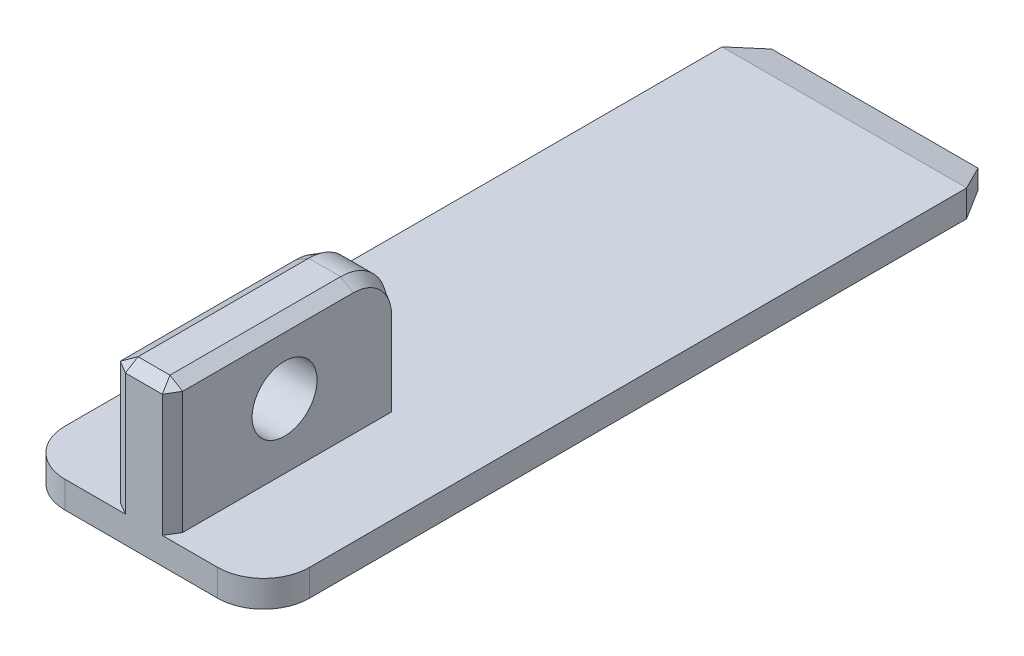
ISO-10303-21;
HEADER;
FILE_DESCRIPTION(('STEP AP214'),'2;1');
FILE_NAME('part.step','',(''),(''),'','','');
FILE_SCHEMA(('AUTOMOTIVE_DESIGN { 1 0 10303 214 1 1 1 1 }'));
ENDSEC;
DATA;
#1=APPLICATION_CONTEXT('core data for automotive mechanical design processes');
#2=APPLICATION_PROTOCOL_DEFINITION('international standard','automotive_design',2000,#1);
#3=PRODUCT_CONTEXT('',#1,'mechanical');
#4=PRODUCT('Part','Part','',(#3));
#5=PRODUCT_RELATED_PRODUCT_CATEGORY('part','',(#4));
#6=PRODUCT_DEFINITION_FORMATION('','',#4);
#7=PRODUCT_DEFINITION_CONTEXT('part definition',#1,'design');
#8=PRODUCT_DEFINITION('design','',#6,#7);
#9=PRODUCT_DEFINITION_SHAPE('','',#8);
#10=(LENGTH_UNIT() NAMED_UNIT(*) SI_UNIT(.MILLI.,.METRE.));
#11=(NAMED_UNIT(*) PLANE_ANGLE_UNIT() SI_UNIT($,.RADIAN.));
#12=(NAMED_UNIT(*) SI_UNIT($,.STERADIAN.) SOLID_ANGLE_UNIT());
#13=UNCERTAINTY_MEASURE_WITH_UNIT(LENGTH_MEASURE(1.E-05),#10,'distance_accuracy_value','');
#14=(GEOMETRIC_REPRESENTATION_CONTEXT(3) GLOBAL_UNCERTAINTY_ASSIGNED_CONTEXT((#13)) GLOBAL_UNIT_ASSIGNED_CONTEXT((#10,
#11,#12)) REPRESENTATION_CONTEXT('',''));
#15=CARTESIAN_POINT('',(0.,0.,0.));
#16=DIRECTION('',(0.,0.,1.));
#17=DIRECTION('',(1.,0.,0.));
#18=AXIS2_PLACEMENT_3D('',#15,#16,#17);
#19=CARTESIAN_POINT('',(-16.,1.75,96.));
#20=DIRECTION('',(0.,-1.,0.));
#21=DIRECTION('',(0.,0.,-1.));
#22=AXIS2_PLACEMENT_3D('',#19,#20,#21);
#23=PLANE('',#22);
#24=DIRECTION('',(0.,0.,-1.));
#25=VECTOR('',#24,1.);
#26=CARTESIAN_POINT('',(-16.,1.75,96.));
#27=LINE('',#26,#25);
#28=CARTESIAN_POINT('',(-16.,1.75,90.));
#29=VERTEX_POINT('',#28);
#30=CARTESIAN_POINT('',(-16.,1.75,4.00000000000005));
#31=VERTEX_POINT('',#30);
#32=EDGE_CURVE('E184',#29,#31,#27,.T.);
#33=ORIENTED_EDGE('',*,*,#32,.F.);
#34=CARTESIAN_POINT('',(-10.,1.75,90.));
#35=DIRECTION('',(0.,-1.,0.));
#36=DIRECTION('',(0.,0.,-1.));
#37=AXIS2_PLACEMENT_3D('',#34,#35,#36);
#38=CIRCLE('',#37,6.);
#39=CARTESIAN_POINT('',(-10.,1.75,96.));
#40=VERTEX_POINT('',#39);
#41=EDGE_CURVE('E245',#29,#40,#38,.F.);
#42=ORIENTED_EDGE('',*,*,#41,.T.);
#43=DIRECTION('',(-1.,0.,0.));
#44=VECTOR('',#43,1.);
#45=CARTESIAN_POINT('',(-16.,1.75,96.));
#46=LINE('',#45,#44);
#47=CARTESIAN_POINT('',(-2.08572051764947,1.75,96.));
#48=VERTEX_POINT('',#47);
#49=EDGE_CURVE('E341',#48,#40,#46,.T.);
#50=ORIENTED_EDGE('',*,*,#49,.F.);
#51=DIRECTION('',(-0.857167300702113,0.,-0.515038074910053));
#52=VECTOR('',#51,1.);
#53=CARTESIAN_POINT('',(-12.3090395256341,1.75,89.8572102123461));
#54=LINE('',#53,#52);
#55=CARTESIAN_POINT('',(-3.75,1.75,95.));
#56=VERTEX_POINT('',#55);
#57=EDGE_CURVE('E11',#48,#56,#54,.T.);
#58=ORIENTED_EDGE('',*,*,#57,.T.);
#59=DIRECTION('',(0.,0.,1.));
#60=VECTOR('',#59,1.);
#61=CARTESIAN_POINT('',(-3.75,1.75,96.));
#62=LINE('',#61,#60);
#63=CARTESIAN_POINT('',(-3.75,1.75,67.));
#64=VERTEX_POINT('',#63);
#65=EDGE_CURVE('E334',#64,#56,#62,.T.);
#66=ORIENTED_EDGE('',*,*,#65,.F.);
#67=DIRECTION('',(-0.857167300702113,0.,0.515038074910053));
#68=VECTOR('',#67,1.);
#69=CARTESIAN_POINT('',(-25.553253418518,1.75,80.1007163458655));
#70=LINE('',#69,#68);
#71=CARTESIAN_POINT('',(-2.08572051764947,1.75,66.));
#72=VERTEX_POINT('',#71);
#73=EDGE_CURVE('E287',#64,#72,#70,.F.);
#74=ORIENTED_EDGE('',*,*,#73,.T.);
#75=DIRECTION('',(-1.,0.,0.));
#76=VECTOR('',#75,1.);
#77=CARTESIAN_POINT('',(-3.75,1.75,66.));
#78=LINE('',#77,#76);
#79=CARTESIAN_POINT('',(2.08572051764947,1.75,66.));
#80=VERTEX_POINT('',#79);
#81=EDGE_CURVE('E331',#80,#72,#78,.T.);
#82=ORIENTED_EDGE('',*,*,#81,.F.);
#83=DIRECTION('',(-0.857167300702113,0.,-0.515038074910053));
#84=VECTOR('',#83,1.);
#85=CARTESIAN_POINT('',(2.04170841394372,1.75,65.9735548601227));
#86=LINE('',#85,#84);
#87=CARTESIAN_POINT('',(3.75,1.75,67.));
#88=VERTEX_POINT('',#87);
#89=EDGE_CURVE('E285',#80,#88,#86,.F.);
#90=ORIENTED_EDGE('',*,*,#89,.T.);
#91=DIRECTION('',(0.,0.,-1.));
#92=VECTOR('',#91,1.);
#93=CARTESIAN_POINT('',(3.75,1.75,96.));
#94=LINE('',#93,#92);
#95=CARTESIAN_POINT('',(3.75,1.75,94.3357205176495));
#96=VERTEX_POINT('',#95);
#97=EDGE_CURVE('E226',#96,#88,#94,.T.);
#98=ORIENTED_EDGE('',*,*,#97,.F.);
#99=DIRECTION('',(-0.515038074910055,0.,0.857167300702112));
#100=VECTOR('',#99,1.);
#101=CARTESIAN_POINT('',(-2.22370409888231,1.75,104.277633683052));
#102=LINE('',#101,#100);
#103=CARTESIAN_POINT('',(2.74999999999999,1.75,96.));
#104=VERTEX_POINT('',#103);
#105=EDGE_CURVE('E51',#96,#104,#102,.T.);
#106=ORIENTED_EDGE('',*,*,#105,.T.);
#107=CARTESIAN_POINT('',(10.,1.75,96.));
#108=VERTEX_POINT('',#107);
#109=EDGE_CURVE('E338',#108,#104,#46,.T.);
#110=ORIENTED_EDGE('',*,*,#109,.F.);
#111=CARTESIAN_POINT('',(10.,1.75,90.));
#112=DIRECTION('',(0.,-1.,0.));
#113=DIRECTION('',(0.,0.,-1.));
#114=AXIS2_PLACEMENT_3D('',#111,#112,#113);
#115=CIRCLE('',#114,6.);
#116=CARTESIAN_POINT('',(16.,1.75,90.));
#117=VERTEX_POINT('',#116);
#118=EDGE_CURVE('E243',#108,#117,#115,.F.);
#119=ORIENTED_EDGE('',*,*,#118,.T.);
#120=DIRECTION('',(0.,0.,-1.));
#121=VECTOR('',#120,1.);
#122=CARTESIAN_POINT('',(16.,1.75,96.));
#123=LINE('',#122,#121);
#124=CARTESIAN_POINT('',(16.,1.75,4.00000000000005));
#125=VERTEX_POINT('',#124);
#126=EDGE_CURVE('E200',#117,#125,#123,.T.);
#127=ORIENTED_EDGE('',*,*,#126,.T.);
#128=DIRECTION('',(-1.,0.,0.));
#129=VECTOR('',#128,1.);
#130=CARTESIAN_POINT('',(-16.,1.75,4.00000000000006));
#131=LINE('',#130,#129);
#132=EDGE_CURVE('E212',#125,#31,#131,.T.);
#133=ORIENTED_EDGE('',*,*,#132,.T.);
#134=EDGE_LOOP('',(#33,#42,#50,#58,#66,#74,#82,#90,#98,#106,#110,#119,#127,#133));
#135=FACE_BOUND('',#134,.T.);
#136=ADVANCED_FACE('F41',(#135),#23,.F.);
#137=CARTESIAN_POINT('',(16.,1.75,96.));
#138=DIRECTION('',(-1.,0.,0.));
#139=DIRECTION('',(0.,0.,1.));
#140=AXIS2_PLACEMENT_3D('',#137,#138,#139);
#141=PLANE('',#140);
#142=ORIENTED_EDGE('',*,*,#126,.F.);
#143=DIRECTION('',(0.,1.,0.));
#144=VECTOR('',#143,1.);
#145=CARTESIAN_POINT('',(16.,-1.75,90.));
#146=LINE('',#145,#144);
#147=CARTESIAN_POINT('',(16.,-1.75,90.));
#148=VERTEX_POINT('',#147);
#149=EDGE_CURVE('E247',#117,#148,#146,.F.);
#150=ORIENTED_EDGE('',*,*,#149,.T.);
#151=DIRECTION('',(0.,0.,-1.));
#152=VECTOR('',#151,1.);
#153=CARTESIAN_POINT('',(16.,-1.75,96.));
#154=LINE('',#153,#152);
#155=CARTESIAN_POINT('',(16.,-1.75,4.00000000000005));
#156=VERTEX_POINT('',#155);
#157=EDGE_CURVE('E185',#148,#156,#154,.T.);
#158=ORIENTED_EDGE('',*,*,#157,.T.);
#159=DIRECTION('',(0.,1.,0.));
#160=VECTOR('',#159,1.);
#161=CARTESIAN_POINT('',(16.,1.75,4.00000000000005));
#162=LINE('',#161,#160);
#163=EDGE_CURVE('E209',#156,#125,#162,.T.);
#164=ORIENTED_EDGE('',*,*,#163,.T.);
#165=EDGE_LOOP('',(#142,#150,#158,#164));
#166=FACE_BOUND('',#165,.T.);
#167=ADVANCED_FACE('F348',(#166),#141,.F.);
#168=CARTESIAN_POINT('',(-16.,1.75,96.));
#169=DIRECTION('',(1.,0.,0.));
#170=DIRECTION('',(0.,0.,-1.));
#171=AXIS2_PLACEMENT_3D('',#168,#169,#170);
#172=PLANE('',#171);
#173=DIRECTION('',(0.,0.,-1.));
#174=VECTOR('',#173,1.);
#175=CARTESIAN_POINT('',(-16.,-1.75,96.));
#176=LINE('',#175,#174);
#177=CARTESIAN_POINT('',(-16.,-1.75,90.));
#178=VERTEX_POINT('',#177);
#179=CARTESIAN_POINT('',(-16.,-1.75,4.00000000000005));
#180=VERTEX_POINT('',#179);
#181=EDGE_CURVE('E173',#178,#180,#176,.T.);
#182=ORIENTED_EDGE('',*,*,#181,.F.);
#183=DIRECTION('',(0.,-1.,0.));
#184=VECTOR('',#183,1.);
#185=CARTESIAN_POINT('',(-16.,1.75,90.));
#186=LINE('',#185,#184);
#187=EDGE_CURVE('E241',#178,#29,#186,.F.);
#188=ORIENTED_EDGE('',*,*,#187,.T.);
#189=ORIENTED_EDGE('',*,*,#32,.T.);
#190=DIRECTION('',(0.,-1.,0.));
#191=VECTOR('',#190,1.);
#192=CARTESIAN_POINT('',(-16.,1.75,4.00000000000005));
#193=LINE('',#192,#191);
#194=EDGE_CURVE('E191',#31,#180,#193,.T.);
#195=ORIENTED_EDGE('',*,*,#194,.T.);
#196=EDGE_LOOP('',(#182,#188,#189,#195));
#197=FACE_BOUND('',#196,.T.);
#198=ADVANCED_FACE('F197',(#197),#172,.F.);
#199=CARTESIAN_POINT('',(-16.,-1.75,96.));
#200=DIRECTION('',(0.,1.,0.));
#201=DIRECTION('',(0.,0.,1.));
#202=AXIS2_PLACEMENT_3D('',#199,#200,#201);
#203=PLANE('',#202);
#204=DIRECTION('',(1.,0.,0.));
#205=VECTOR('',#204,1.);
#206=CARTESIAN_POINT('',(-16.,-1.75,96.));
#207=LINE('',#206,#205);
#208=CARTESIAN_POINT('',(-10.,-1.75,96.));
#209=VERTEX_POINT('',#208);
#210=CARTESIAN_POINT('',(10.,-1.75,96.));
#211=VERTEX_POINT('',#210);
#212=EDGE_CURVE('E340',#209,#211,#207,.T.);
#213=ORIENTED_EDGE('',*,*,#212,.F.);
#214=CARTESIAN_POINT('',(-10.,-1.75,90.));
#215=DIRECTION('',(0.,1.,0.));
#216=DIRECTION('',(0.,0.,1.));
#217=AXIS2_PLACEMENT_3D('',#214,#215,#216);
#218=CIRCLE('',#217,6.);
#219=EDGE_CURVE('E180',#209,#178,#218,.F.);
#220=ORIENTED_EDGE('',*,*,#219,.T.);
#221=ORIENTED_EDGE('',*,*,#181,.T.);
#222=DIRECTION('',(-0.529998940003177,0.,0.84799830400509));
#223=VECTOR('',#222,1.);
#224=CARTESIAN_POINT('',(-16.,-1.75,4.00000000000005));
#225=LINE('',#224,#223);
#226=CARTESIAN_POINT('',(-13.5,-1.75,0.));
#227=VERTEX_POINT('',#226);
#228=EDGE_CURVE('E178',#180,#227,#225,.F.);
#229=ORIENTED_EDGE('',*,*,#228,.T.);
#230=DIRECTION('',(1.,0.,0.));
#231=VECTOR('',#230,1.);
#232=CARTESIAN_POINT('',(-16.,-1.75,0.));
#233=LINE('',#232,#231);
#234=CARTESIAN_POINT('',(13.5,-1.75,0.));
#235=VERTEX_POINT('',#234);
#236=EDGE_CURVE('E337',#227,#235,#233,.T.);
#237=ORIENTED_EDGE('',*,*,#236,.T.);
#238=DIRECTION('',(-0.529998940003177,0.,-0.84799830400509));
#239=VECTOR('',#238,1.);
#240=CARTESIAN_POINT('',(16.,-1.75,4.00000000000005));
#241=LINE('',#240,#239);
#242=EDGE_CURVE('E195',#235,#156,#241,.F.);
#243=ORIENTED_EDGE('',*,*,#242,.T.);
#244=ORIENTED_EDGE('',*,*,#157,.F.);
#245=CARTESIAN_POINT('',(10.,-1.75,90.));
#246=DIRECTION('',(0.,1.,0.));
#247=DIRECTION('',(0.,0.,1.));
#248=AXIS2_PLACEMENT_3D('',#245,#246,#247);
#249=CIRCLE('',#248,6.);
#250=EDGE_CURVE('E238',#148,#211,#249,.F.);
#251=ORIENTED_EDGE('',*,*,#250,.T.);
#252=EDGE_LOOP('',(#213,#220,#221,#229,#237,#243,#244,#251));
#253=FACE_BOUND('',#252,.T.);
#254=ADVANCED_FACE('F176',(#253),#203,.F.);
#255=CARTESIAN_POINT('',(0.,0.,96.));
#256=DIRECTION('',(0.,0.,1.));
#257=DIRECTION('',(1.,0.,0.));
#258=AXIS2_PLACEMENT_3D('',#255,#256,#257);
#259=PLANE('',#258);
#260=DIRECTION('',(0.,-1.,0.));
#261=VECTOR('',#260,1.);
#262=CARTESIAN_POINT('',(-2.08572051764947,1.75,96.));
#263=LINE('',#262,#261);
#264=CARTESIAN_POINT('',(-2.08572051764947,17.75,96.));
#265=VERTEX_POINT('',#264);
#266=EDGE_CURVE('E276',#265,#48,#263,.T.);
#267=ORIENTED_EDGE('',*,*,#266,.T.);
#268=ORIENTED_EDGE('',*,*,#49,.T.);
#269=DIRECTION('',(0.,-1.,0.));
#270=VECTOR('',#269,1.);
#271=CARTESIAN_POINT('',(-10.,-1.75,96.));
#272=LINE('',#271,#270);
#273=EDGE_CURVE('E235',#40,#209,#272,.T.);
#274=ORIENTED_EDGE('',*,*,#273,.T.);
#275=ORIENTED_EDGE('',*,*,#212,.T.);
#276=DIRECTION('',(0.,1.,0.));
#277=VECTOR('',#276,1.);
#278=CARTESIAN_POINT('',(10.,1.75,96.));
#279=LINE('',#278,#277);
#280=EDGE_CURVE('E232',#211,#108,#279,.T.);
#281=ORIENTED_EDGE('',*,*,#280,.T.);
#282=ORIENTED_EDGE('',*,*,#109,.T.);
#283=DIRECTION('',(0.,1.,0.));
#284=VECTOR('',#283,1.);
#285=CARTESIAN_POINT('',(2.74999999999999,18.75,96.));
#286=LINE('',#285,#284);
#287=CARTESIAN_POINT('',(2.74999999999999,17.75,96.));
#288=VERTEX_POINT('',#287);
#289=EDGE_CURVE('E279',#104,#288,#286,.T.);
#290=ORIENTED_EDGE('',*,*,#289,.T.);
#291=DIRECTION('',(-1.,0.,0.));
#292=VECTOR('',#291,1.);
#293=CARTESIAN_POINT('',(-3.75,17.75,96.));
#294=LINE('',#293,#292);
#295=EDGE_CURVE('E274',#288,#265,#294,.T.);
#296=ORIENTED_EDGE('',*,*,#295,.T.);
#297=EDGE_LOOP('',(#267,#268,#274,#275,#281,#282,#290,#296));
#298=FACE_BOUND('',#297,.T.);
#299=ADVANCED_FACE('F368',(#298),#259,.T.);
#300=CARTESIAN_POINT('',(0.,0.,0.));
#301=DIRECTION('',(0.,0.,1.));
#302=DIRECTION('',(1.,0.,0.));
#303=AXIS2_PLACEMENT_3D('',#300,#301,#302);
#304=PLANE('',#303);
#305=DIRECTION('',(0.,1.,0.));
#306=VECTOR('',#305,1.);
#307=CARTESIAN_POINT('',(-13.5,0.,0.));
#308=LINE('',#307,#306);
#309=CARTESIAN_POINT('',(-13.5,0.749999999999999,0.));
#310=VERTEX_POINT('',#309);
#311=EDGE_CURVE('E193',#227,#310,#308,.T.);
#312=ORIENTED_EDGE('',*,*,#311,.T.);
#313=DIRECTION('',(1.,0.,0.));
#314=VECTOR('',#313,1.);
#315=CARTESIAN_POINT('',(0.,0.749999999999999,0.));
#316=LINE('',#315,#314);
#317=CARTESIAN_POINT('',(13.5,0.749999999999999,0.));
#318=VERTEX_POINT('',#317);
#319=EDGE_CURVE('E217',#310,#318,#316,.T.);
#320=ORIENTED_EDGE('',*,*,#319,.T.);
#321=DIRECTION('',(0.,-1.,0.));
#322=VECTOR('',#321,1.);
#323=CARTESIAN_POINT('',(13.5,0.,0.));
#324=LINE('',#323,#322);
#325=EDGE_CURVE('E194',#318,#235,#324,.T.);
#326=ORIENTED_EDGE('',*,*,#325,.T.);
#327=ORIENTED_EDGE('',*,*,#236,.F.);
#328=EDGE_LOOP('',(#312,#320,#326,#327));
#329=FACE_BOUND('',#328,.T.);
#330=ADVANCED_FACE('F451',(#329),#304,.F.);
#331=CARTESIAN_POINT('',(-16.,1.75,4.00000000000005));
#332=DIRECTION('',(0.84799830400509,0.,0.529998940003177));
#333=DIRECTION('',(0.,-1.,0.));
#334=AXIS2_PLACEMENT_3D('',#331,#332,#333);
#335=PLANE('',#334);
#336=ORIENTED_EDGE('',*,*,#194,.F.);
#337=DIRECTION('',(0.51847584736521,-0.207390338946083,-0.829561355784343));
#338=VECTOR('',#337,1.);
#339=CARTESIAN_POINT('',(-16.,1.75,4.00000000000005));
#340=LINE('',#339,#338);
#341=EDGE_CURVE('E215',#31,#310,#340,.T.);
#342=ORIENTED_EDGE('',*,*,#341,.T.);
#343=ORIENTED_EDGE('',*,*,#311,.F.);
#344=ORIENTED_EDGE('',*,*,#228,.F.);
#345=EDGE_LOOP('',(#336,#342,#343,#344));
#346=FACE_BOUND('',#345,.T.);
#347=ADVANCED_FACE('F190',(#346),#335,.F.);
#348=CARTESIAN_POINT('',(16.,1.75,4.00000000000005));
#349=DIRECTION('',(-0.84799830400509,0.,0.529998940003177));
#350=DIRECTION('',(0.,1.,0.));
#351=AXIS2_PLACEMENT_3D('',#348,#349,#350);
#352=PLANE('',#351);
#353=ORIENTED_EDGE('',*,*,#325,.F.);
#354=DIRECTION('',(0.51847584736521,0.207390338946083,0.829561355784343));
#355=VECTOR('',#354,1.);
#356=CARTESIAN_POINT('',(16.,1.75,4.00000000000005));
#357=LINE('',#356,#355);
#358=EDGE_CURVE('E219',#318,#125,#357,.T.);
#359=ORIENTED_EDGE('',*,*,#358,.T.);
#360=ORIENTED_EDGE('',*,*,#163,.F.);
#361=ORIENTED_EDGE('',*,*,#242,.F.);
#362=EDGE_LOOP('',(#353,#359,#360,#361));
#363=FACE_BOUND('',#362,.T.);
#364=ADVANCED_FACE('F356',(#363),#352,.F.);
#365=CARTESIAN_POINT('',(-16.,1.75,4.00000000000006));
#366=DIRECTION('',(0.,-0.970142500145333,0.24253562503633));
#367=DIRECTION('',(-1.,0.,0.));
#368=AXIS2_PLACEMENT_3D('',#365,#366,#367);
#369=PLANE('',#368);
#370=ORIENTED_EDGE('',*,*,#358,.F.);
#371=ORIENTED_EDGE('',*,*,#319,.F.);
#372=ORIENTED_EDGE('',*,*,#341,.F.);
#373=ORIENTED_EDGE('',*,*,#132,.F.);
#374=EDGE_LOOP('',(#370,#371,#372,#373));
#375=FACE_BOUND('',#374,.T.);
#376=ADVANCED_FACE('F360',(#375),#369,.F.);
#377=CARTESIAN_POINT('',(3.75,18.75,96.));
#378=DIRECTION('',(-1.,0.,0.));
#379=DIRECTION('',(0.,0.,1.));
#380=AXIS2_PLACEMENT_3D('',#377,#378,#379);
#381=PLANE('',#380);
#382=ORIENTED_EDGE('',*,*,#97,.T.);
#383=DIRECTION('',(0.,1.,0.));
#384=VECTOR('',#383,1.);
#385=CARTESIAN_POINT('',(3.75,18.75,67.));
#386=LINE('',#385,#384);
#387=CARTESIAN_POINT('',(3.75,12.75,67.));
#388=VERTEX_POINT('',#387);
#389=EDGE_CURVE('E260',#88,#388,#386,.T.);
#390=ORIENTED_EDGE('',*,*,#389,.T.);
#391=CARTESIAN_POINT('',(3.75,12.75,72.));
#392=DIRECTION('',(-1.,0.,0.));
#393=DIRECTION('',(0.,0.,1.));
#394=AXIS2_PLACEMENT_3D('',#391,#392,#393);
#395=CIRCLE('',#394,4.99999999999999);
#396=CARTESIAN_POINT('',(3.75,17.75,72.));
#397=VERTEX_POINT('',#396);
#398=EDGE_CURVE('E258',#388,#397,#395,.F.);
#399=ORIENTED_EDGE('',*,*,#398,.T.);
#400=DIRECTION('',(0.,0.,1.));
#401=VECTOR('',#400,1.);
#402=CARTESIAN_POINT('',(3.75,17.75,96.));
#403=LINE('',#402,#401);
#404=CARTESIAN_POINT('',(3.75,17.75,94.3357205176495));
#405=VERTEX_POINT('',#404);
#406=EDGE_CURVE('E254',#397,#405,#403,.T.);
#407=ORIENTED_EDGE('',*,*,#406,.T.);
#408=DIRECTION('',(0.,-1.,0.));
#409=VECTOR('',#408,1.);
#410=CARTESIAN_POINT('',(3.75,1.75,94.3357205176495));
#411=LINE('',#410,#409);
#412=EDGE_CURVE('E256',#405,#96,#411,.T.);
#413=ORIENTED_EDGE('',*,*,#412,.T.);
#414=EDGE_LOOP('',(#382,#390,#399,#407,#413));
#415=FACE_BOUND('',#414,.T.);
#416=CARTESIAN_POINT('',(3.74999999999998,10.25,81.));
#417=DIRECTION('',(1.,0.,0.));
#418=DIRECTION('',(0.,0.,-1.));
#419=AXIS2_PLACEMENT_3D('',#416,#417,#418);
#420=CIRCLE('',#419,4.25000000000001);
#421=CARTESIAN_POINT('',(3.74999999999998,10.25,76.75));
#422=VERTEX_POINT('',#421);
#423=EDGE_CURVE('E227',#422,#422,#420,.T.);
#424=ORIENTED_EDGE('',*,*,#423,.F.);
#425=EDGE_LOOP('',(#424));
#426=FACE_BOUND('',#425,.T.);
#427=ADVANCED_FACE('F420',(#415,#426),#381,.F.);
#428=CARTESIAN_POINT('',(-3.75,18.75,66.));
#429=DIRECTION('',(0.,0.,1.));
#430=DIRECTION('',(1.,0.,0.));
#431=AXIS2_PLACEMENT_3D('',#428,#429,#430);
#432=PLANE('',#431);
#433=DIRECTION('',(-1.,0.,0.));
#434=VECTOR('',#433,1.);
#435=CARTESIAN_POINT('',(-3.75,12.75,66.));
#436=LINE('',#435,#434);
#437=CARTESIAN_POINT('',(-2.08572051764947,12.75,66.));
#438=VERTEX_POINT('',#437);
#439=CARTESIAN_POINT('',(2.08572051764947,12.75,66.));
#440=VERTEX_POINT('',#439);
#441=EDGE_CURVE('E229',#438,#440,#436,.F.);
#442=ORIENTED_EDGE('',*,*,#441,.T.);
#443=DIRECTION('',(0.,-1.,0.));
#444=VECTOR('',#443,1.);
#445=CARTESIAN_POINT('',(2.08572051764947,18.75,66.));
#446=LINE('',#445,#444);
#447=EDGE_CURVE('E251',#440,#80,#446,.T.);
#448=ORIENTED_EDGE('',*,*,#447,.T.);
#449=ORIENTED_EDGE('',*,*,#81,.T.);
#450=DIRECTION('',(0.,1.,0.));
#451=VECTOR('',#450,1.);
#452=CARTESIAN_POINT('',(-2.08572051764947,18.75,66.));
#453=LINE('',#452,#451);
#454=EDGE_CURVE('E249',#72,#438,#453,.T.);
#455=ORIENTED_EDGE('',*,*,#454,.T.);
#456=EDGE_LOOP('',(#442,#448,#449,#455));
#457=FACE_BOUND('',#456,.T.);
#458=ADVANCED_FACE('F411',(#457),#432,.F.);
#459=CARTESIAN_POINT('',(-3.75,18.75,96.));
#460=DIRECTION('',(1.,0.,0.));
#461=DIRECTION('',(0.,0.,-1.));
#462=AXIS2_PLACEMENT_3D('',#459,#460,#461);
#463=PLANE('',#462);
#464=CARTESIAN_POINT('',(-3.75,10.25,81.));
#465=DIRECTION('',(1.,0.,0.));
#466=DIRECTION('',(0.,0.,-1.));
#467=AXIS2_PLACEMENT_3D('',#464,#465,#466);
#468=CIRCLE('',#467,4.25000000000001);
#469=CARTESIAN_POINT('',(-3.75,10.25,76.75));
#470=VERTEX_POINT('',#469);
#471=EDGE_CURVE('E223',#470,#470,#468,.T.);
#472=ORIENTED_EDGE('',*,*,#471,.T.);
#473=EDGE_LOOP('',(#472));
#474=FACE_BOUND('',#473,.T.);
#475=CARTESIAN_POINT('',(-3.75,12.75,72.));
#476=DIRECTION('',(1.,0.,0.));
#477=DIRECTION('',(0.,0.,-1.));
#478=AXIS2_PLACEMENT_3D('',#475,#476,#477);
#479=CIRCLE('',#478,4.99999999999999);
#480=CARTESIAN_POINT('',(-3.75,17.75,72.));
#481=VERTEX_POINT('',#480);
#482=CARTESIAN_POINT('',(-3.75,12.75,67.));
#483=VERTEX_POINT('',#482);
#484=EDGE_CURVE('E266',#481,#483,#479,.F.);
#485=ORIENTED_EDGE('',*,*,#484,.T.);
#486=DIRECTION('',(0.,-1.,0.));
#487=VECTOR('',#486,1.);
#488=CARTESIAN_POINT('',(-3.75,18.75,67.));
#489=LINE('',#488,#487);
#490=EDGE_CURVE('E268',#483,#64,#489,.T.);
#491=ORIENTED_EDGE('',*,*,#490,.T.);
#492=ORIENTED_EDGE('',*,*,#65,.T.);
#493=DIRECTION('',(0.,1.,0.));
#494=VECTOR('',#493,1.);
#495=CARTESIAN_POINT('',(-3.75,18.75,95.));
#496=LINE('',#495,#494);
#497=CARTESIAN_POINT('',(-3.75,17.75,95.));
#498=VERTEX_POINT('',#497);
#499=EDGE_CURVE('E264',#56,#498,#496,.T.);
#500=ORIENTED_EDGE('',*,*,#499,.T.);
#501=DIRECTION('',(0.,0.,-1.));
#502=VECTOR('',#501,1.);
#503=CARTESIAN_POINT('',(-3.75,17.75,96.));
#504=LINE('',#503,#502);
#505=EDGE_CURVE('E262',#498,#481,#504,.T.);
#506=ORIENTED_EDGE('',*,*,#505,.T.);
#507=EDGE_LOOP('',(#485,#491,#492,#500,#506));
#508=FACE_BOUND('',#507,.T.);
#509=ADVANCED_FACE('F382',(#474,#508),#463,.F.);
#510=CARTESIAN_POINT('',(0.,18.75,0.));
#511=DIRECTION('',(0.,-1.,0.));
#512=DIRECTION('',(0.,0.,-1.));
#513=AXIS2_PLACEMENT_3D('',#510,#511,#512);
#514=PLANE('',#513);
#515=DIRECTION('',(1.,0.,0.));
#516=VECTOR('',#515,1.);
#517=CARTESIAN_POINT('',(3.75,18.75,94.3357205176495));
#518=LINE('',#517,#516);
#519=CARTESIAN_POINT('',(-2.08572051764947,18.75,94.3357205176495));
#520=VERTEX_POINT('',#519);
#521=CARTESIAN_POINT('',(2.08572051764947,18.75,94.3357205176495));
#522=VERTEX_POINT('',#521);
#523=EDGE_CURVE('E59',#520,#522,#518,.T.);
#524=ORIENTED_EDGE('',*,*,#523,.T.);
#525=DIRECTION('',(0.,0.,-1.));
#526=VECTOR('',#525,1.);
#527=CARTESIAN_POINT('',(2.08572051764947,18.75,0.));
#528=LINE('',#527,#526);
#529=CARTESIAN_POINT('',(2.08572051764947,18.75,72.));
#530=VERTEX_POINT('',#529);
#531=EDGE_CURVE('E283',#522,#530,#528,.T.);
#532=ORIENTED_EDGE('',*,*,#531,.T.);
#533=DIRECTION('',(-1.,0.,0.));
#534=VECTOR('',#533,1.);
#535=CARTESIAN_POINT('',(0.,18.75,72.));
#536=LINE('',#535,#534);
#537=CARTESIAN_POINT('',(-2.08572051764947,18.75,72.));
#538=VERTEX_POINT('',#537);
#539=EDGE_CURVE('E222',#530,#538,#536,.T.);
#540=ORIENTED_EDGE('',*,*,#539,.T.);
#541=DIRECTION('',(0.,0.,1.));
#542=VECTOR('',#541,1.);
#543=CARTESIAN_POINT('',(-2.08572051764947,18.75,0.));
#544=LINE('',#543,#542);
#545=EDGE_CURVE('E64',#538,#520,#544,.T.);
#546=ORIENTED_EDGE('',*,*,#545,.T.);
#547=EDGE_LOOP('',(#524,#532,#540,#546));
#548=FACE_BOUND('',#547,.T.);
#549=ADVANCED_FACE('F400',(#548),#514,.F.);
#550=CARTESIAN_POINT('',(-16.,10.25,81.));
#551=DIRECTION('',(1.,0.,0.));
#552=DIRECTION('',(0.,0.,-1.));
#553=AXIS2_PLACEMENT_3D('',#550,#551,#552);
#554=CYLINDRICAL_SURFACE('',#553,4.25000000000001);
#555=ORIENTED_EDGE('',*,*,#423,.T.);
#556=EDGE_LOOP('',(#555));
#557=FACE_BOUND('',#556,.T.);
#558=ORIENTED_EDGE('',*,*,#471,.F.);
#559=EDGE_LOOP('',(#558));
#560=FACE_BOUND('',#559,.T.);
#561=ADVANCED_FACE('F463',(#557,#560),#554,.F.);
#562=CARTESIAN_POINT('',(0.,12.75,72.));
#563=DIRECTION('',(-1.,0.,0.));
#564=DIRECTION('',(0.,0.,1.));
#565=AXIS2_PLACEMENT_3D('',#562,#563,#564);
#566=CYLINDRICAL_SURFACE('',#565,6.);
#567=ORIENTED_EDGE('',*,*,#539,.F.);
#568=CARTESIAN_POINT('',(2.08572051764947,12.75,72.));
#569=DIRECTION('',(-1.,0.,0.));
#570=DIRECTION('',(0.,0.,1.));
#571=AXIS2_PLACEMENT_3D('',#568,#569,#570);
#572=CIRCLE('',#571,6.);
#573=EDGE_CURVE('E272',#530,#440,#572,.T.);
#574=ORIENTED_EDGE('',*,*,#573,.T.);
#575=ORIENTED_EDGE('',*,*,#441,.F.);
#576=CARTESIAN_POINT('',(-2.08572051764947,12.75,72.));
#577=DIRECTION('',(1.,0.,0.));
#578=DIRECTION('',(0.,0.,-1.));
#579=AXIS2_PLACEMENT_3D('',#576,#577,#578);
#580=CIRCLE('',#579,6.);
#581=EDGE_CURVE('E270',#438,#538,#580,.T.);
#582=ORIENTED_EDGE('',*,*,#581,.T.);
#583=EDGE_LOOP('',(#567,#574,#575,#582));
#584=FACE_BOUND('',#583,.T.);
#585=ADVANCED_FACE('F402',(#584),#566,.T.);
#586=CARTESIAN_POINT('',(-10.,0.,90.));
#587=DIRECTION('',(0.,1.,0.));
#588=DIRECTION('',(0.,0.,1.));
#589=AXIS2_PLACEMENT_3D('',#586,#587,#588);
#590=CYLINDRICAL_SURFACE('',#589,6.);
#591=ORIENTED_EDGE('',*,*,#41,.F.);
#592=ORIENTED_EDGE('',*,*,#187,.F.);
#593=ORIENTED_EDGE('',*,*,#219,.F.);
#594=ORIENTED_EDGE('',*,*,#273,.F.);
#595=EDGE_LOOP('',(#591,#592,#593,#594));
#596=FACE_BOUND('',#595,.T.);
#597=ADVANCED_FACE('F372',(#596),#590,.T.);
#598=CARTESIAN_POINT('',(10.,0.,90.));
#599=DIRECTION('',(0.,-1.,0.));
#600=DIRECTION('',(0.,0.,-1.));
#601=AXIS2_PLACEMENT_3D('',#598,#599,#600);
#602=CYLINDRICAL_SURFACE('',#601,6.);
#603=ORIENTED_EDGE('',*,*,#250,.F.);
#604=ORIENTED_EDGE('',*,*,#149,.F.);
#605=ORIENTED_EDGE('',*,*,#118,.F.);
#606=ORIENTED_EDGE('',*,*,#280,.F.);
#607=EDGE_LOOP('',(#603,#604,#605,#606));
#608=FACE_BOUND('',#607,.T.);
#609=ADVANCED_FACE('F365',(#608),#602,.T.);
#610=CARTESIAN_POINT('',(-3.75,18.75,67.));
#611=DIRECTION('',(0.515038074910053,0.,0.857167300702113));
#612=DIRECTION('',(0.,-1.,0.));
#613=AXIS2_PLACEMENT_3D('',#610,#611,#612);
#614=PLANE('',#613);
#615=ORIENTED_EDGE('',*,*,#73,.F.);
#616=ORIENTED_EDGE('',*,*,#490,.F.);
#617=DIRECTION('',(-0.857167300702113,0.,0.515038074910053));
#618=VECTOR('',#617,1.);
#619=CARTESIAN_POINT('',(-2.08572051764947,12.75,66.));
#620=LINE('',#619,#618);
#621=EDGE_CURVE('E46',#438,#483,#620,.T.);
#622=ORIENTED_EDGE('',*,*,#621,.F.);
#623=ORIENTED_EDGE('',*,*,#454,.F.);
#624=EDGE_LOOP('',(#615,#616,#622,#623));
#625=FACE_BOUND('',#624,.T.);
#626=ADVANCED_FACE('F44',(#625),#614,.F.);
#627=CARTESIAN_POINT('',(-3.75,12.75,72.));
#628=DIRECTION('',(1.,0.,0.));
#629=DIRECTION('',(0.,0.,-1.));
#630=AXIS2_PLACEMENT_3D('',#627,#628,#629);
#631=CONICAL_SURFACE('',#630,4.99999999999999,0.541052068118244);
#632=ORIENTED_EDGE('',*,*,#621,.T.);
#633=ORIENTED_EDGE('',*,*,#484,.F.);
#634=DIRECTION('',(-0.857167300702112,-0.515038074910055,0.));
#635=VECTOR('',#634,1.);
#636=CARTESIAN_POINT('',(-2.08572051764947,18.75,72.));
#637=LINE('',#636,#635);
#638=EDGE_CURVE('E314',#538,#481,#637,.T.);
#639=ORIENTED_EDGE('',*,*,#638,.F.);
#640=ORIENTED_EDGE('',*,*,#581,.F.);
#641=EDGE_LOOP('',(#632,#633,#639,#640));
#642=FACE_BOUND('',#641,.T.);
#643=ADVANCED_FACE('F404',(#642),#631,.T.);
#644=CARTESIAN_POINT('',(-2.08572051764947,0.,96.));
#645=DIRECTION('',(-0.515038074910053,0.,0.857167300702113));
#646=DIRECTION('',(0.,1.,0.));
#647=AXIS2_PLACEMENT_3D('',#644,#645,#646);
#648=PLANE('',#647);
#649=ORIENTED_EDGE('',*,*,#57,.F.);
#650=ORIENTED_EDGE('',*,*,#266,.F.);
#651=DIRECTION('',(0.857167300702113,0.,0.515038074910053));
#652=VECTOR('',#651,1.);
#653=CARTESIAN_POINT('',(-3.75,17.75,95.));
#654=LINE('',#653,#652);
#655=EDGE_CURVE('E312',#498,#265,#654,.T.);
#656=ORIENTED_EDGE('',*,*,#655,.F.);
#657=ORIENTED_EDGE('',*,*,#499,.F.);
#658=EDGE_LOOP('',(#649,#650,#656,#657));
#659=FACE_BOUND('',#658,.T.);
#660=ADVANCED_FACE('F380',(#659),#648,.T.);
#661=CARTESIAN_POINT('',(-2.08572051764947,18.75,0.));
#662=DIRECTION('',(0.515038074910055,-0.857167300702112,0.));
#663=DIRECTION('',(0.,0.,1.));
#664=AXIS2_PLACEMENT_3D('',#661,#662,#663);
#665=PLANE('',#664);
#666=ORIENTED_EDGE('',*,*,#638,.T.);
#667=ORIENTED_EDGE('',*,*,#505,.F.);
#668=DIRECTION('',(0.811014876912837,0.487306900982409,-0.323707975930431));
#669=VECTOR('',#668,1.);
#670=CARTESIAN_POINT('',(-3.75,17.75,95.));
#671=LINE('',#670,#669);
#672=EDGE_CURVE('E309',#520,#498,#671,.F.);
#673=ORIENTED_EDGE('',*,*,#672,.F.);
#674=ORIENTED_EDGE('',*,*,#545,.F.);
#675=EDGE_LOOP('',(#666,#667,#673,#674));
#676=FACE_BOUND('',#675,.T.);
#677=ADVANCED_FACE('F383',(#676),#665,.F.);
#678=CARTESIAN_POINT('',(-3.75,17.75,95.));
#679=DIRECTION('',(-0.29563341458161,0.818853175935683,0.4920166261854));
#680=DIRECTION('',(0.,-0.515038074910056,0.857167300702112));
#681=AXIS2_PLACEMENT_3D('',#678,#679,#680);
#682=PLANE('',#681);
#683=ORIENTED_EDGE('',*,*,#672,.T.);
#684=ORIENTED_EDGE('',*,*,#655,.T.);
#685=DIRECTION('',(0.,0.515038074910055,-0.857167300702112));
#686=VECTOR('',#685,1.);
#687=CARTESIAN_POINT('',(-2.08572051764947,18.1914737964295,95.2652642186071));
#688=LINE('',#687,#686);
#689=EDGE_CURVE('E306',#520,#265,#688,.F.);
#690=ORIENTED_EDGE('',*,*,#689,.F.);
#691=EDGE_LOOP('',(#683,#684,#690));
#692=FACE_BOUND('',#691,.T.);
#693=ADVANCED_FACE('F386',(#692),#682,.T.);
#694=CARTESIAN_POINT('',(3.75,18.75,94.3357205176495));
#695=DIRECTION('',(0.857167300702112,0.,0.515038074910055));
#696=DIRECTION('',(0.,1.,0.));
#697=AXIS2_PLACEMENT_3D('',#694,#695,#696);
#698=PLANE('',#697);
#699=ORIENTED_EDGE('',*,*,#105,.F.);
#700=ORIENTED_EDGE('',*,*,#412,.F.);
#701=DIRECTION('',(0.515038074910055,0.,-0.857167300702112));
#702=VECTOR('',#701,1.);
#703=CARTESIAN_POINT('',(2.74999999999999,17.75,96.));
#704=LINE('',#703,#702);
#705=EDGE_CURVE('E303',#288,#405,#704,.T.);
#706=ORIENTED_EDGE('',*,*,#705,.F.);
#707=ORIENTED_EDGE('',*,*,#289,.F.);
#708=EDGE_LOOP('',(#699,#700,#706,#707));
#709=FACE_BOUND('',#708,.T.);
#710=ADVANCED_FACE('F425',(#709),#698,.T.);
#711=CARTESIAN_POINT('',(0.,18.75,94.3357205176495));
#712=DIRECTION('',(0.,0.857167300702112,0.515038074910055));
#713=DIRECTION('',(-1.,0.,0.));
#714=AXIS2_PLACEMENT_3D('',#711,#712,#713);
#715=PLANE('',#714);
#716=ORIENTED_EDGE('',*,*,#689,.T.);
#717=ORIENTED_EDGE('',*,*,#295,.F.);
#718=DIRECTION('',(0.323707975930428,-0.48730690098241,0.811014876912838));
#719=VECTOR('',#718,1.);
#720=CARTESIAN_POINT('',(2.74999999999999,17.75,96.));
#721=LINE('',#720,#719);
#722=EDGE_CURVE('E300',#522,#288,#721,.T.);
#723=ORIENTED_EDGE('',*,*,#722,.F.);
#724=ORIENTED_EDGE('',*,*,#523,.F.);
#725=EDGE_LOOP('',(#716,#717,#723,#724));
#726=FACE_BOUND('',#725,.T.);
#727=ADVANCED_FACE('F388',(#726),#715,.T.);
#728=CARTESIAN_POINT('',(2.74999999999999,17.75,96.));
#729=DIRECTION('',(0.4920166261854,0.818853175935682,0.295633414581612));
#730=DIRECTION('',(-0.857167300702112,0.515038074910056,0.));
#731=AXIS2_PLACEMENT_3D('',#728,#729,#730);
#732=PLANE('',#731);
#733=ORIENTED_EDGE('',*,*,#722,.T.);
#734=ORIENTED_EDGE('',*,*,#705,.T.);
#735=DIRECTION('',(0.857167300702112,-0.515038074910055,0.));
#736=VECTOR('',#735,1.);
#737=CARTESIAN_POINT('',(3.01526421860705,18.1914737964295,94.3357205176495));
#738=LINE('',#737,#736);
#739=EDGE_CURVE('E297',#522,#405,#738,.T.);
#740=ORIENTED_EDGE('',*,*,#739,.F.);
#741=EDGE_LOOP('',(#733,#734,#740));
#742=FACE_BOUND('',#741,.T.);
#743=ADVANCED_FACE('F393',(#742),#732,.T.);
#744=CARTESIAN_POINT('',(2.08572051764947,18.75,0.));
#745=DIRECTION('',(-0.515038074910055,-0.857167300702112,0.));
#746=DIRECTION('',(0.,0.,-1.));
#747=AXIS2_PLACEMENT_3D('',#744,#745,#746);
#748=PLANE('',#747);
#749=ORIENTED_EDGE('',*,*,#739,.T.);
#750=ORIENTED_EDGE('',*,*,#406,.F.);
#751=DIRECTION('',(0.857167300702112,-0.515038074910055,0.));
#752=VECTOR('',#751,1.);
#753=CARTESIAN_POINT('',(2.08572051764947,18.75,72.));
#754=LINE('',#753,#752);
#755=EDGE_CURVE('E294',#530,#397,#754,.T.);
#756=ORIENTED_EDGE('',*,*,#755,.F.);
#757=ORIENTED_EDGE('',*,*,#531,.F.);
#758=EDGE_LOOP('',(#749,#750,#756,#757));
#759=FACE_BOUND('',#758,.T.);
#760=ADVANCED_FACE('F397',(#759),#748,.F.);
#761=CARTESIAN_POINT('',(3.75,12.75,72.));
#762=DIRECTION('',(-1.,0.,0.));
#763=DIRECTION('',(0.,0.,1.));
#764=AXIS2_PLACEMENT_3D('',#761,#762,#763);
#765=CONICAL_SURFACE('',#764,4.99999999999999,0.541052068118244);
#766=ORIENTED_EDGE('',*,*,#755,.T.);
#767=ORIENTED_EDGE('',*,*,#398,.F.);
#768=DIRECTION('',(0.85716730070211,0.,0.515038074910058));
#769=VECTOR('',#768,1.);
#770=CARTESIAN_POINT('',(2.08572051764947,12.75,66.));
#771=LINE('',#770,#769);
#772=EDGE_CURVE('E291',#440,#388,#771,.T.);
#773=ORIENTED_EDGE('',*,*,#772,.F.);
#774=ORIENTED_EDGE('',*,*,#573,.F.);
#775=EDGE_LOOP('',(#766,#767,#773,#774));
#776=FACE_BOUND('',#775,.T.);
#777=ADVANCED_FACE('F474',(#776),#765,.T.);
#778=CARTESIAN_POINT('',(2.08572051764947,18.75,66.));
#779=DIRECTION('',(-0.515038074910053,0.,0.857167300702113));
#780=DIRECTION('',(0.,-1.,0.));
#781=AXIS2_PLACEMENT_3D('',#778,#779,#780);
#782=PLANE('',#781);
#783=ORIENTED_EDGE('',*,*,#772,.T.);
#784=ORIENTED_EDGE('',*,*,#389,.F.);
#785=ORIENTED_EDGE('',*,*,#89,.F.);
#786=ORIENTED_EDGE('',*,*,#447,.F.);
#787=EDGE_LOOP('',(#783,#784,#785,#786));
#788=FACE_BOUND('',#787,.T.);
#789=ADVANCED_FACE('F415',(#788),#782,.F.);
#790=CLOSED_SHELL('',(#136,#167,#198,#254,#299,#330,#347,#364,#376,#427,#458,#509,#549,#561,
#585,#597,#609,#626,#643,#660,#677,#693,#710,#727,#743,#760,#777,#789));
#791=MANIFOLD_SOLID_BREP('B2',#790);
#792=ADVANCED_BREP_SHAPE_REPRESENTATION('',(#18,#791),#14);
#793=SHAPE_DEFINITION_REPRESENTATION(#9,#792);
ENDSEC;
END-ISO-10303-21;
